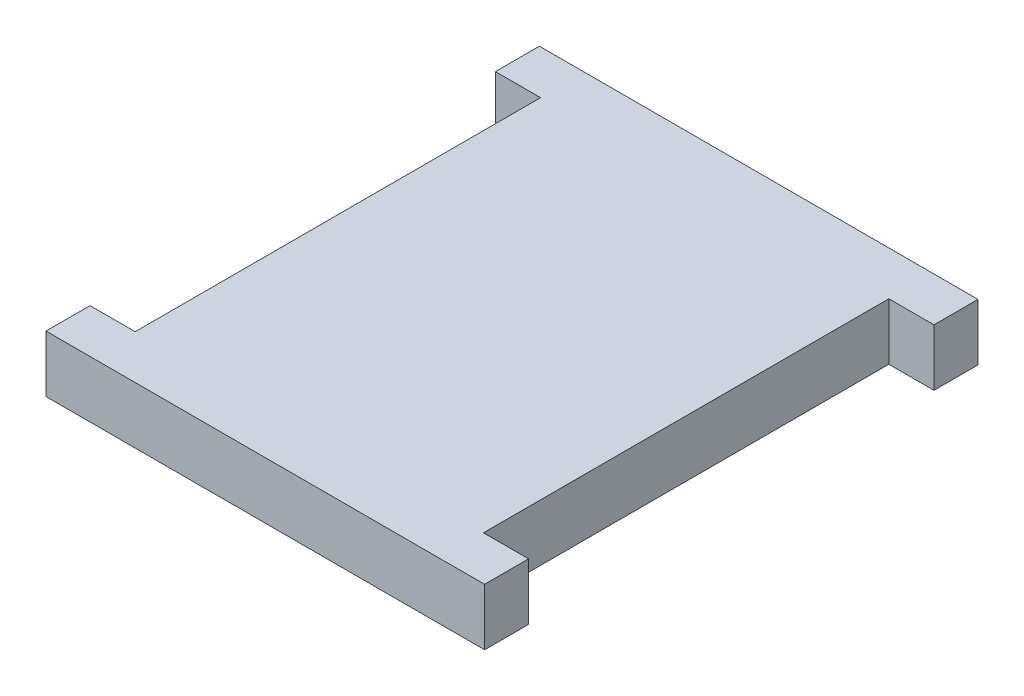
ISO-10303-21;
HEADER;
FILE_DESCRIPTION(('STEP AP214'),'2;1');
FILE_NAME('part.step','',(''),(''),'','','');
FILE_SCHEMA(('AUTOMOTIVE_DESIGN { 1 0 10303 214 1 1 1 1 }'));
ENDSEC;
DATA;
#1=APPLICATION_CONTEXT('core data for automotive mechanical design processes');
#2=APPLICATION_PROTOCOL_DEFINITION('international standard','automotive_design',2000,#1);
#3=PRODUCT_CONTEXT('',#1,'mechanical');
#4=PRODUCT('Part','Part','',(#3));
#5=PRODUCT_RELATED_PRODUCT_CATEGORY('part','',(#4));
#6=PRODUCT_DEFINITION_FORMATION('','',#4);
#7=PRODUCT_DEFINITION_CONTEXT('part definition',#1,'design');
#8=PRODUCT_DEFINITION('design','',#6,#7);
#9=PRODUCT_DEFINITION_SHAPE('','',#8);
#10=(LENGTH_UNIT() NAMED_UNIT(*) SI_UNIT(.MILLI.,.METRE.));
#11=(NAMED_UNIT(*) PLANE_ANGLE_UNIT() SI_UNIT($,.RADIAN.));
#12=(NAMED_UNIT(*) SI_UNIT($,.STERADIAN.) SOLID_ANGLE_UNIT());
#13=UNCERTAINTY_MEASURE_WITH_UNIT(LENGTH_MEASURE(1.E-05),#10,'distance_accuracy_value','');
#14=(GEOMETRIC_REPRESENTATION_CONTEXT(3) GLOBAL_UNCERTAINTY_ASSIGNED_CONTEXT((#13)) GLOBAL_UNIT_ASSIGNED_CONTEXT((#10,
#11,#12)) REPRESENTATION_CONTEXT('',''));
#15=CARTESIAN_POINT('',(0.,0.,0.));
#16=DIRECTION('',(0.,0.,1.));
#17=DIRECTION('',(1.,0.,0.));
#18=AXIS2_PLACEMENT_3D('',#15,#16,#17);
#19=CARTESIAN_POINT('',(68.,8.8,-62.85));
#20=DIRECTION('',(-1.,0.,0.));
#21=DIRECTION('',(0.,0.,1.));
#22=AXIS2_PLACEMENT_3D('',#19,#20,#21);
#23=PLANE('',#22);
#24=DIRECTION('',(0.,0.,-1.));
#25=VECTOR('',#24,1.);
#26=CARTESIAN_POINT('',(68.,-8.8,-62.85));
#27=LINE('',#26,#25);
#28=CARTESIAN_POINT('',(68.,-8.8,-62.85));
#29=VERTEX_POINT('',#28);
#30=CARTESIAN_POINT('',(68.,-8.8,-76.5));
#31=VERTEX_POINT('',#30);
#32=EDGE_CURVE('E159',#29,#31,#27,.T.);
#33=ORIENTED_EDGE('',*,*,#32,.T.);
#34=DIRECTION('',(0.,-1.,0.));
#35=VECTOR('',#34,1.);
#36=CARTESIAN_POINT('',(68.,8.8,-76.5));
#37=LINE('',#36,#35);
#38=CARTESIAN_POINT('',(68.,8.8,-76.5));
#39=VERTEX_POINT('',#38);
#40=EDGE_CURVE('E11',#39,#31,#37,.T.);
#41=ORIENTED_EDGE('',*,*,#40,.F.);
#42=DIRECTION('',(0.,0.,-1.));
#43=VECTOR('',#42,1.);
#44=CARTESIAN_POINT('',(68.,8.8,-62.85));
#45=LINE('',#44,#43);
#46=CARTESIAN_POINT('',(68.,8.8,-62.85));
#47=VERTEX_POINT('',#46);
#48=EDGE_CURVE('E181',#47,#39,#45,.T.);
#49=ORIENTED_EDGE('',*,*,#48,.F.);
#50=DIRECTION('',(0.,-1.,0.));
#51=VECTOR('',#50,1.);
#52=CARTESIAN_POINT('',(68.,8.8,-62.85));
#53=LINE('',#52,#51);
#54=EDGE_CURVE('E155',#47,#29,#53,.T.);
#55=ORIENTED_EDGE('',*,*,#54,.T.);
#56=EDGE_LOOP('',(#33,#41,#49,#55));
#57=FACE_BOUND('',#56,.T.);
#58=ADVANCED_FACE('F39',(#57),#23,.F.);
#59=CARTESIAN_POINT('',(-68.,8.8,-76.5));
#60=DIRECTION('',(0.,0.,1.));
#61=DIRECTION('',(1.,0.,0.));
#62=AXIS2_PLACEMENT_3D('',#59,#60,#61);
#63=PLANE('',#62);
#64=DIRECTION('',(-1.,0.,0.));
#65=VECTOR('',#64,1.);
#66=CARTESIAN_POINT('',(-68.,-8.8,-76.5));
#67=LINE('',#66,#65);
#68=CARTESIAN_POINT('',(-68.,-8.8,-76.5));
#69=VERTEX_POINT('',#68);
#70=EDGE_CURVE('E162',#31,#69,#67,.T.);
#71=ORIENTED_EDGE('',*,*,#70,.T.);
#72=DIRECTION('',(0.,-1.,0.));
#73=VECTOR('',#72,1.);
#74=CARTESIAN_POINT('',(-68.,8.8,-76.5));
#75=LINE('',#74,#73);
#76=CARTESIAN_POINT('',(-68.,8.8,-76.5));
#77=VERTEX_POINT('',#76);
#78=EDGE_CURVE('E47',#77,#69,#75,.T.);
#79=ORIENTED_EDGE('',*,*,#78,.F.);
#80=DIRECTION('',(-1.,0.,0.));
#81=VECTOR('',#80,1.);
#82=CARTESIAN_POINT('',(-68.,8.8,-76.5));
#83=LINE('',#82,#81);
#84=EDGE_CURVE('E110',#39,#77,#83,.T.);
#85=ORIENTED_EDGE('',*,*,#84,.F.);
#86=ORIENTED_EDGE('',*,*,#40,.T.);
#87=EDGE_LOOP('',(#71,#79,#85,#86));
#88=FACE_BOUND('',#87,.T.);
#89=ADVANCED_FACE('F259',(#88),#63,.F.);
#90=CARTESIAN_POINT('',(-68.,8.8,-62.85));
#91=DIRECTION('',(1.,0.,0.));
#92=DIRECTION('',(0.,0.,-1.));
#93=AXIS2_PLACEMENT_3D('',#90,#91,#92);
#94=PLANE('',#93);
#95=DIRECTION('',(0.,0.,1.));
#96=VECTOR('',#95,1.);
#97=CARTESIAN_POINT('',(-68.,-8.8,-62.85));
#98=LINE('',#97,#96);
#99=CARTESIAN_POINT('',(-68.,-8.8,-62.85));
#100=VERTEX_POINT('',#99);
#101=EDGE_CURVE('E164',#69,#100,#98,.T.);
#102=ORIENTED_EDGE('',*,*,#101,.T.);
#103=DIRECTION('',(0.,-1.,0.));
#104=VECTOR('',#103,1.);
#105=CARTESIAN_POINT('',(-68.,8.8,-62.85));
#106=LINE('',#105,#104);
#107=CARTESIAN_POINT('',(-68.,8.8,-62.85));
#108=VERTEX_POINT('',#107);
#109=EDGE_CURVE('E200',#108,#100,#106,.T.);
#110=ORIENTED_EDGE('',*,*,#109,.F.);
#111=DIRECTION('',(0.,0.,1.));
#112=VECTOR('',#111,1.);
#113=CARTESIAN_POINT('',(-68.,8.8,-62.85));
#114=LINE('',#113,#112);
#115=EDGE_CURVE('E208',#77,#108,#114,.T.);
#116=ORIENTED_EDGE('',*,*,#115,.F.);
#117=ORIENTED_EDGE('',*,*,#78,.T.);
#118=EDGE_LOOP('',(#102,#110,#116,#117));
#119=FACE_BOUND('',#118,.T.);
#120=ADVANCED_FACE('F206',(#119),#94,.F.);
#121=CARTESIAN_POINT('',(-68.,8.8,-62.85));
#122=DIRECTION('',(0.,0.,-1.));
#123=DIRECTION('',(-1.,0.,0.));
#124=AXIS2_PLACEMENT_3D('',#121,#122,#123);
#125=PLANE('',#124);
#126=DIRECTION('',(1.,0.,0.));
#127=VECTOR('',#126,1.);
#128=CARTESIAN_POINT('',(-68.,-8.8,-62.85));
#129=LINE('',#128,#127);
#130=CARTESIAN_POINT('',(-54.0000000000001,-8.8,-62.85));
#131=VERTEX_POINT('',#130);
#132=EDGE_CURVE('E166',#100,#131,#129,.T.);
#133=ORIENTED_EDGE('',*,*,#132,.T.);
#134=DIRECTION('',(0.,-1.,0.));
#135=VECTOR('',#134,1.);
#136=CARTESIAN_POINT('',(-54.0000000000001,8.8,-62.85));
#137=LINE('',#136,#135);
#138=CARTESIAN_POINT('',(-54.0000000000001,8.8,-62.85));
#139=VERTEX_POINT('',#138);
#140=EDGE_CURVE('E197',#139,#131,#137,.T.);
#141=ORIENTED_EDGE('',*,*,#140,.F.);
#142=DIRECTION('',(1.,0.,0.));
#143=VECTOR('',#142,1.);
#144=CARTESIAN_POINT('',(-68.,8.8,-62.85));
#145=LINE('',#144,#143);
#146=EDGE_CURVE('E226',#108,#139,#145,.T.);
#147=ORIENTED_EDGE('',*,*,#146,.F.);
#148=ORIENTED_EDGE('',*,*,#109,.T.);
#149=EDGE_LOOP('',(#133,#141,#147,#148));
#150=FACE_BOUND('',#149,.T.);
#151=ADVANCED_FACE('F217',(#150),#125,.F.);
#152=CARTESIAN_POINT('',(-54.0000000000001,8.8,-62.85));
#153=DIRECTION('',(1.,0.,0.));
#154=DIRECTION('',(0.,0.,-1.));
#155=AXIS2_PLACEMENT_3D('',#152,#153,#154);
#156=PLANE('',#155);
#157=DIRECTION('',(0.,0.,1.));
#158=VECTOR('',#157,1.);
#159=CARTESIAN_POINT('',(-54.0000000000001,-8.8,-62.85));
#160=LINE('',#159,#158);
#161=CARTESIAN_POINT('',(-54.,-8.8,62.8500000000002));
#162=VERTEX_POINT('',#161);
#163=EDGE_CURVE('E168',#131,#162,#160,.T.);
#164=ORIENTED_EDGE('',*,*,#163,.T.);
#165=DIRECTION('',(0.,-1.,0.));
#166=VECTOR('',#165,1.);
#167=CARTESIAN_POINT('',(-54.,8.8,62.8500000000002));
#168=LINE('',#167,#166);
#169=CARTESIAN_POINT('',(-54.,8.8,62.8500000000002));
#170=VERTEX_POINT('',#169);
#171=EDGE_CURVE('E194',#170,#162,#168,.T.);
#172=ORIENTED_EDGE('',*,*,#171,.F.);
#173=DIRECTION('',(0.,0.,1.));
#174=VECTOR('',#173,1.);
#175=CARTESIAN_POINT('',(-54.0000000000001,8.8,-62.85));
#176=LINE('',#175,#174);
#177=EDGE_CURVE('E223',#139,#170,#176,.T.);
#178=ORIENTED_EDGE('',*,*,#177,.F.);
#179=ORIENTED_EDGE('',*,*,#140,.T.);
#180=EDGE_LOOP('',(#164,#172,#178,#179));
#181=FACE_BOUND('',#180,.T.);
#182=ADVANCED_FACE('F221',(#181),#156,.F.);
#183=CARTESIAN_POINT('',(-54.,8.8,62.8500000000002));
#184=DIRECTION('',(0.,0.,1.));
#185=DIRECTION('',(1.,0.,0.));
#186=AXIS2_PLACEMENT_3D('',#183,#184,#185);
#187=PLANE('',#186);
#188=DIRECTION('',(-1.,0.,0.));
#189=VECTOR('',#188,1.);
#190=CARTESIAN_POINT('',(-54.,-8.8,62.8500000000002));
#191=LINE('',#190,#189);
#192=CARTESIAN_POINT('',(-68.,-8.8,62.8500000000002));
#193=VERTEX_POINT('',#192);
#194=EDGE_CURVE('E170',#162,#193,#191,.T.);
#195=ORIENTED_EDGE('',*,*,#194,.T.);
#196=DIRECTION('',(0.,-1.,0.));
#197=VECTOR('',#196,1.);
#198=CARTESIAN_POINT('',(-68.,8.8,62.8500000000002));
#199=LINE('',#198,#197);
#200=CARTESIAN_POINT('',(-68.,8.8,62.8500000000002));
#201=VERTEX_POINT('',#200);
#202=EDGE_CURVE('E191',#201,#193,#199,.T.);
#203=ORIENTED_EDGE('',*,*,#202,.F.);
#204=DIRECTION('',(-1.,0.,0.));
#205=VECTOR('',#204,1.);
#206=CARTESIAN_POINT('',(-54.,8.8,62.8500000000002));
#207=LINE('',#206,#205);
#208=EDGE_CURVE('E225',#170,#201,#207,.T.);
#209=ORIENTED_EDGE('',*,*,#208,.F.);
#210=ORIENTED_EDGE('',*,*,#171,.T.);
#211=EDGE_LOOP('',(#195,#203,#209,#210));
#212=FACE_BOUND('',#211,.T.);
#213=ADVANCED_FACE('F272',(#212),#187,.F.);
#214=CARTESIAN_POINT('',(-68.,8.8,76.5));
#215=DIRECTION('',(1.,0.,0.));
#216=DIRECTION('',(0.,0.,-1.));
#217=AXIS2_PLACEMENT_3D('',#214,#215,#216);
#218=PLANE('',#217);
#219=DIRECTION('',(0.,0.,1.));
#220=VECTOR('',#219,1.);
#221=CARTESIAN_POINT('',(-68.,-8.8,76.5));
#222=LINE('',#221,#220);
#223=CARTESIAN_POINT('',(-68.,-8.8,76.5));
#224=VERTEX_POINT('',#223);
#225=EDGE_CURVE('E172',#193,#224,#222,.T.);
#226=ORIENTED_EDGE('',*,*,#225,.T.);
#227=DIRECTION('',(0.,-1.,0.));
#228=VECTOR('',#227,1.);
#229=CARTESIAN_POINT('',(-68.,8.8,76.5));
#230=LINE('',#229,#228);
#231=CARTESIAN_POINT('',(-68.,8.8,76.5));
#232=VERTEX_POINT('',#231);
#233=EDGE_CURVE('E188',#232,#224,#230,.T.);
#234=ORIENTED_EDGE('',*,*,#233,.F.);
#235=DIRECTION('',(0.,0.,1.));
#236=VECTOR('',#235,1.);
#237=CARTESIAN_POINT('',(-68.,8.8,76.5));
#238=LINE('',#237,#236);
#239=EDGE_CURVE('E228',#201,#232,#238,.T.);
#240=ORIENTED_EDGE('',*,*,#239,.F.);
#241=ORIENTED_EDGE('',*,*,#202,.T.);
#242=EDGE_LOOP('',(#226,#234,#240,#241));
#243=FACE_BOUND('',#242,.T.);
#244=ADVANCED_FACE('F275',(#243),#218,.F.);
#245=CARTESIAN_POINT('',(-68.,8.8,76.5));
#246=DIRECTION('',(0.,0.,-1.));
#247=DIRECTION('',(-1.,0.,0.));
#248=AXIS2_PLACEMENT_3D('',#245,#246,#247);
#249=PLANE('',#248);
#250=DIRECTION('',(1.,0.,0.));
#251=VECTOR('',#250,1.);
#252=CARTESIAN_POINT('',(-68.,-8.8,76.5));
#253=LINE('',#252,#251);
#254=CARTESIAN_POINT('',(68.,-8.8,76.5));
#255=VERTEX_POINT('',#254);
#256=EDGE_CURVE('E174',#224,#255,#253,.T.);
#257=ORIENTED_EDGE('',*,*,#256,.T.);
#258=DIRECTION('',(0.,-1.,0.));
#259=VECTOR('',#258,1.);
#260=CARTESIAN_POINT('',(68.,8.8,76.5));
#261=LINE('',#260,#259);
#262=CARTESIAN_POINT('',(68.,8.8,76.5));
#263=VERTEX_POINT('',#262);
#264=EDGE_CURVE('E185',#263,#255,#261,.T.);
#265=ORIENTED_EDGE('',*,*,#264,.F.);
#266=DIRECTION('',(1.,0.,0.));
#267=VECTOR('',#266,1.);
#268=CARTESIAN_POINT('',(-68.,8.8,76.5));
#269=LINE('',#268,#267);
#270=EDGE_CURVE('E234',#232,#263,#269,.T.);
#271=ORIENTED_EDGE('',*,*,#270,.F.);
#272=ORIENTED_EDGE('',*,*,#233,.T.);
#273=EDGE_LOOP('',(#257,#265,#271,#272));
#274=FACE_BOUND('',#273,.T.);
#275=ADVANCED_FACE('F240',(#274),#249,.F.);
#276=CARTESIAN_POINT('',(68.,8.8,76.5));
#277=DIRECTION('',(-1.,0.,0.));
#278=DIRECTION('',(0.,0.,1.));
#279=AXIS2_PLACEMENT_3D('',#276,#277,#278);
#280=PLANE('',#279);
#281=DIRECTION('',(0.,0.,-1.));
#282=VECTOR('',#281,1.);
#283=CARTESIAN_POINT('',(68.,-8.8,76.5));
#284=LINE('',#283,#282);
#285=CARTESIAN_POINT('',(68.,-8.8,62.85));
#286=VERTEX_POINT('',#285);
#287=EDGE_CURVE('E176',#255,#286,#284,.T.);
#288=ORIENTED_EDGE('',*,*,#287,.T.);
#289=DIRECTION('',(0.,-1.,0.));
#290=VECTOR('',#289,1.);
#291=CARTESIAN_POINT('',(68.,8.8,62.85));
#292=LINE('',#291,#290);
#293=CARTESIAN_POINT('',(68.,8.8,62.85));
#294=VERTEX_POINT('',#293);
#295=EDGE_CURVE('E150',#294,#286,#292,.T.);
#296=ORIENTED_EDGE('',*,*,#295,.F.);
#297=DIRECTION('',(0.,0.,-1.));
#298=VECTOR('',#297,1.);
#299=CARTESIAN_POINT('',(68.,8.8,76.5));
#300=LINE('',#299,#298);
#301=EDGE_CURVE('E141',#263,#294,#300,.T.);
#302=ORIENTED_EDGE('',*,*,#301,.F.);
#303=ORIENTED_EDGE('',*,*,#264,.T.);
#304=EDGE_LOOP('',(#288,#296,#302,#303));
#305=FACE_BOUND('',#304,.T.);
#306=ADVANCED_FACE('F244',(#305),#280,.F.);
#307=CARTESIAN_POINT('',(54.,8.8,62.85));
#308=DIRECTION('',(0.,0.,1.));
#309=DIRECTION('',(1.,0.,0.));
#310=AXIS2_PLACEMENT_3D('',#307,#308,#309);
#311=PLANE('',#310);
#312=DIRECTION('',(-1.,0.,0.));
#313=VECTOR('',#312,1.);
#314=CARTESIAN_POINT('',(54.,-8.8,62.85));
#315=LINE('',#314,#313);
#316=CARTESIAN_POINT('',(54.,-8.8,62.85));
#317=VERTEX_POINT('',#316);
#318=EDGE_CURVE('E149',#286,#317,#315,.T.);
#319=ORIENTED_EDGE('',*,*,#318,.T.);
#320=DIRECTION('',(0.,-1.,0.));
#321=VECTOR('',#320,1.);
#322=CARTESIAN_POINT('',(54.,8.8,62.85));
#323=LINE('',#322,#321);
#324=CARTESIAN_POINT('',(54.,8.8,62.85));
#325=VERTEX_POINT('',#324);
#326=EDGE_CURVE('E146',#325,#317,#323,.T.);
#327=ORIENTED_EDGE('',*,*,#326,.F.);
#328=DIRECTION('',(-1.,0.,0.));
#329=VECTOR('',#328,1.);
#330=CARTESIAN_POINT('',(54.,8.8,62.85));
#331=LINE('',#330,#329);
#332=EDGE_CURVE('E135',#294,#325,#331,.T.);
#333=ORIENTED_EDGE('',*,*,#332,.F.);
#334=ORIENTED_EDGE('',*,*,#295,.T.);
#335=EDGE_LOOP('',(#319,#327,#333,#334));
#336=FACE_BOUND('',#335,.T.);
#337=ADVANCED_FACE('F147',(#336),#311,.F.);
#338=CARTESIAN_POINT('',(54.,8.8,-62.85));
#339=DIRECTION('',(-1.,0.,0.));
#340=DIRECTION('',(0.,0.,1.));
#341=AXIS2_PLACEMENT_3D('',#338,#339,#340);
#342=PLANE('',#341);
#343=DIRECTION('',(0.,0.,-1.));
#344=VECTOR('',#343,1.);
#345=CARTESIAN_POINT('',(54.,-8.8,-62.85));
#346=LINE('',#345,#344);
#347=CARTESIAN_POINT('',(54.,-8.8,-62.85));
#348=VERTEX_POINT('',#347);
#349=EDGE_CURVE('E96',#317,#348,#346,.T.);
#350=ORIENTED_EDGE('',*,*,#349,.T.);
#351=DIRECTION('',(0.,-1.,0.));
#352=VECTOR('',#351,1.);
#353=CARTESIAN_POINT('',(54.,8.8,-62.85));
#354=LINE('',#353,#352);
#355=CARTESIAN_POINT('',(54.,8.8,-62.85));
#356=VERTEX_POINT('',#355);
#357=EDGE_CURVE('E151',#356,#348,#354,.T.);
#358=ORIENTED_EDGE('',*,*,#357,.F.);
#359=DIRECTION('',(0.,0.,-1.));
#360=VECTOR('',#359,1.);
#361=CARTESIAN_POINT('',(54.,8.8,-62.85));
#362=LINE('',#361,#360);
#363=EDGE_CURVE('E139',#325,#356,#362,.T.);
#364=ORIENTED_EDGE('',*,*,#363,.F.);
#365=ORIENTED_EDGE('',*,*,#326,.T.);
#366=EDGE_LOOP('',(#350,#358,#364,#365));
#367=FACE_BOUND('',#366,.T.);
#368=ADVANCED_FACE('F153',(#367),#342,.F.);
#369=CARTESIAN_POINT('',(68.,8.8,-62.85));
#370=DIRECTION('',(0.,0.,-1.));
#371=DIRECTION('',(-1.,0.,0.));
#372=AXIS2_PLACEMENT_3D('',#369,#370,#371);
#373=PLANE('',#372);
#374=DIRECTION('',(1.,0.,0.));
#375=VECTOR('',#374,1.);
#376=CARTESIAN_POINT('',(68.,-8.8,-62.85));
#377=LINE('',#376,#375);
#378=EDGE_CURVE('E102',#348,#29,#377,.T.);
#379=ORIENTED_EDGE('',*,*,#378,.T.);
#380=ORIENTED_EDGE('',*,*,#54,.F.);
#381=DIRECTION('',(1.,0.,0.));
#382=VECTOR('',#381,1.);
#383=CARTESIAN_POINT('',(68.,8.8,-62.85));
#384=LINE('',#383,#382);
#385=EDGE_CURVE('E55',#356,#47,#384,.T.);
#386=ORIENTED_EDGE('',*,*,#385,.F.);
#387=ORIENTED_EDGE('',*,*,#357,.T.);
#388=EDGE_LOOP('',(#379,#380,#386,#387));
#389=FACE_BOUND('',#388,.T.);
#390=ADVANCED_FACE('F248',(#389),#373,.F.);
#391=CARTESIAN_POINT('',(0.,8.8,0.));
#392=DIRECTION('',(0.,-1.,0.));
#393=DIRECTION('',(0.,0.,-1.));
#394=AXIS2_PLACEMENT_3D('',#391,#392,#393);
#395=PLANE('',#394);
#396=ORIENTED_EDGE('',*,*,#48,.T.);
#397=ORIENTED_EDGE('',*,*,#84,.T.);
#398=ORIENTED_EDGE('',*,*,#115,.T.);
#399=ORIENTED_EDGE('',*,*,#146,.T.);
#400=ORIENTED_EDGE('',*,*,#177,.T.);
#401=ORIENTED_EDGE('',*,*,#208,.T.);
#402=ORIENTED_EDGE('',*,*,#239,.T.);
#403=ORIENTED_EDGE('',*,*,#270,.T.);
#404=ORIENTED_EDGE('',*,*,#301,.T.);
#405=ORIENTED_EDGE('',*,*,#332,.T.);
#406=ORIENTED_EDGE('',*,*,#363,.T.);
#407=ORIENTED_EDGE('',*,*,#385,.T.);
#408=EDGE_LOOP('',(#396,#397,#398,#399,#400,#401,#402,#403,#404,#405,#406,#407));
#409=FACE_BOUND('',#408,.T.);
#410=ADVANCED_FACE('F137',(#409),#395,.F.);
#411=CARTESIAN_POINT('',(0.,-8.8,0.));
#412=DIRECTION('',(0.,-1.,0.));
#413=DIRECTION('',(0.,0.,-1.));
#414=AXIS2_PLACEMENT_3D('',#411,#412,#413);
#415=PLANE('',#414);
#416=ORIENTED_EDGE('',*,*,#32,.F.);
#417=ORIENTED_EDGE('',*,*,#378,.F.);
#418=ORIENTED_EDGE('',*,*,#349,.F.);
#419=ORIENTED_EDGE('',*,*,#318,.F.);
#420=ORIENTED_EDGE('',*,*,#287,.F.);
#421=ORIENTED_EDGE('',*,*,#256,.F.);
#422=ORIENTED_EDGE('',*,*,#225,.F.);
#423=ORIENTED_EDGE('',*,*,#194,.F.);
#424=ORIENTED_EDGE('',*,*,#163,.F.);
#425=ORIENTED_EDGE('',*,*,#132,.F.);
#426=ORIENTED_EDGE('',*,*,#101,.F.);
#427=ORIENTED_EDGE('',*,*,#70,.F.);
#428=EDGE_LOOP('',(#416,#417,#418,#419,#420,#421,#422,#423,#424,#425,#426,#427));
#429=FACE_BOUND('',#428,.T.);
#430=ADVANCED_FACE('F212',(#429),#415,.T.);
#431=CLOSED_SHELL('',(#58,#89,#120,#151,#182,#213,#244,#275,#306,#337,#368,#390,#410,#430));
#432=MANIFOLD_SOLID_BREP('B2',#431);
#433=ADVANCED_BREP_SHAPE_REPRESENTATION('',(#18,#432),#14);
#434=SHAPE_DEFINITION_REPRESENTATION(#9,#433);
ENDSEC;
END-ISO-10303-21;
